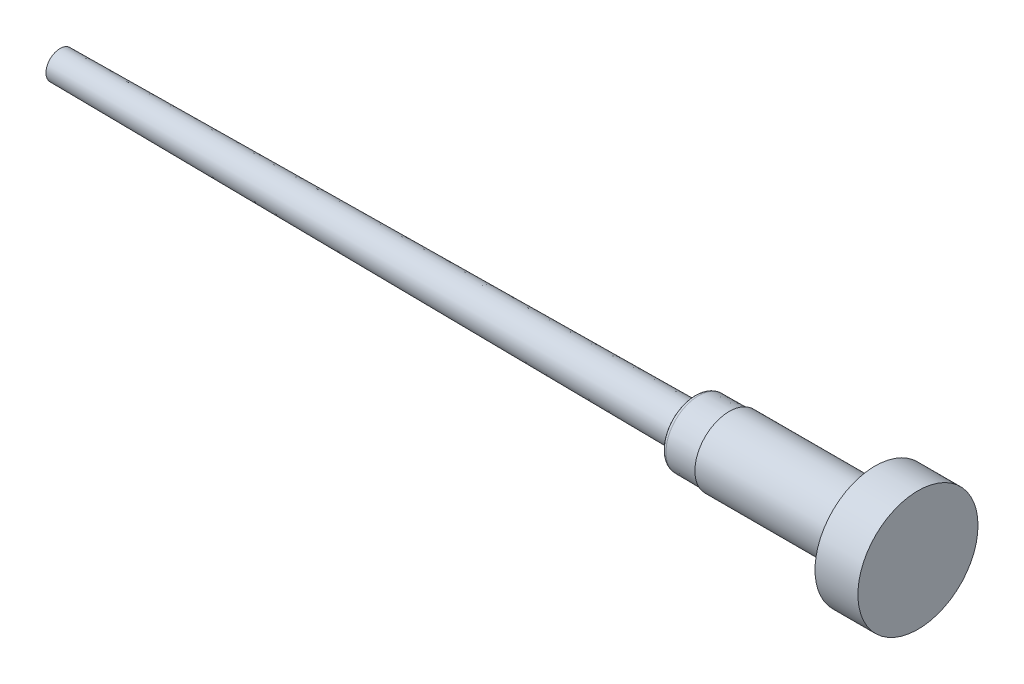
ISO-10303-21;
HEADER;
FILE_DESCRIPTION(('STEP AP214'),'2;1');
FILE_NAME('part.step','',(''),(''),'','','');
FILE_SCHEMA(('AUTOMOTIVE_DESIGN { 1 0 10303 214 1 1 1 1 }'));
ENDSEC;
DATA;
#1=APPLICATION_CONTEXT('core data for automotive mechanical design processes');
#2=APPLICATION_PROTOCOL_DEFINITION('international standard','automotive_design',2000,#1);
#3=PRODUCT_CONTEXT('',#1,'mechanical');
#4=PRODUCT('Part','Part','',(#3));
#5=PRODUCT_RELATED_PRODUCT_CATEGORY('part','',(#4));
#6=PRODUCT_DEFINITION_FORMATION('','',#4);
#7=PRODUCT_DEFINITION_CONTEXT('part definition',#1,'design');
#8=PRODUCT_DEFINITION('design','',#6,#7);
#9=PRODUCT_DEFINITION_SHAPE('','',#8);
#10=(LENGTH_UNIT() NAMED_UNIT(*) SI_UNIT(.MILLI.,.METRE.));
#11=(NAMED_UNIT(*) PLANE_ANGLE_UNIT() SI_UNIT($,.RADIAN.));
#12=(NAMED_UNIT(*) SI_UNIT($,.STERADIAN.) SOLID_ANGLE_UNIT());
#13=UNCERTAINTY_MEASURE_WITH_UNIT(LENGTH_MEASURE(1.E-05),#10,'distance_accuracy_value','');
#14=(GEOMETRIC_REPRESENTATION_CONTEXT(3) GLOBAL_UNCERTAINTY_ASSIGNED_CONTEXT((#13)) GLOBAL_UNIT_ASSIGNED_CONTEXT((#10,
#11,#12)) REPRESENTATION_CONTEXT('',''));
#15=CARTESIAN_POINT('',(0.,0.,0.));
#16=DIRECTION('',(0.,0.,1.));
#17=DIRECTION('',(1.,0.,0.));
#18=AXIS2_PLACEMENT_3D('',#15,#16,#17);
#19=CARTESIAN_POINT('',(87.,2.4459601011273E-13,0.));
#20=DIRECTION('',(1.,0.,0.));
#21=DIRECTION('',(0.,0.,-1.));
#22=AXIS2_PLACEMENT_3D('',#19,#20,#21);
#23=CYLINDRICAL_SURFACE('',#22,6.99999999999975);
#24=CARTESIAN_POINT('',(82.0000000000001,2.4459601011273E-13,0.));
#25=DIRECTION('',(1.,0.,0.));
#26=DIRECTION('',(0.,0.,-1.));
#27=AXIS2_PLACEMENT_3D('',#24,#25,#26);
#28=CIRCLE('',#27,6.99999999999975);
#29=CARTESIAN_POINT('',(82.0000000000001,2.4459601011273E-13,-6.99999999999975));
#30=VERTEX_POINT('',#29);
#31=EDGE_CURVE('E10',#30,#30,#28,.T.);
#32=ORIENTED_EDGE('',*,*,#31,.T.);
#33=EDGE_LOOP('',(#32));
#34=FACE_BOUND('',#33,.T.);
#35=CARTESIAN_POINT('',(87.,2.4459601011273E-13,0.));
#36=DIRECTION('',(1.,0.,0.));
#37=DIRECTION('',(0.,0.,-1.));
#38=AXIS2_PLACEMENT_3D('',#35,#36,#37);
#39=CIRCLE('',#38,6.99999999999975);
#40=CARTESIAN_POINT('',(87.,2.4459601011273E-13,-6.99999999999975));
#41=VERTEX_POINT('',#40);
#42=EDGE_CURVE('E66',#41,#41,#39,.T.);
#43=ORIENTED_EDGE('',*,*,#42,.F.);
#44=EDGE_LOOP('',(#43));
#45=FACE_BOUND('',#44,.T.);
#46=ADVANCED_FACE('F29',(#34,#45),#23,.T.);
#47=CARTESIAN_POINT('',(82.,7.,0.));
#48=DIRECTION('',(-1.,0.,0.));
#49=DIRECTION('',(0.,0.,1.));
#50=AXIS2_PLACEMENT_3D('',#47,#48,#49);
#51=PLANE('',#50);
#52=CARTESIAN_POINT('',(82.,2.4459601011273E-13,0.));
#53=DIRECTION('',(1.,0.,0.));
#54=DIRECTION('',(0.,0.,-1.));
#55=AXIS2_PLACEMENT_3D('',#52,#53,#54);
#56=CIRCLE('',#55,4.50000000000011);
#57=CARTESIAN_POINT('',(82.,2.4459601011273E-13,-4.50000000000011));
#58=VERTEX_POINT('',#57);
#59=EDGE_CURVE('E35',#58,#58,#56,.T.);
#60=ORIENTED_EDGE('',*,*,#59,.T.);
#61=EDGE_LOOP('',(#60));
#62=FACE_BOUND('',#61,.T.);
#63=ORIENTED_EDGE('',*,*,#31,.F.);
#64=EDGE_LOOP('',(#63));
#65=FACE_BOUND('',#64,.T.);
#66=ADVANCED_FACE('F73',(#62,#65),#51,.T.);
#67=CARTESIAN_POINT('',(81.5,2.4459601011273E-13,0.));
#68=DIRECTION('',(1.,0.,0.));
#69=DIRECTION('',(0.,0.,-1.));
#70=AXIS2_PLACEMENT_3D('',#67,#68,#69);
#71=TOROIDAL_SURFACE('',#70,4.50000000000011,0.5);
#72=CARTESIAN_POINT('',(81.5,2.4459601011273E-13,0.));
#73=DIRECTION('',(1.,0.,0.));
#74=DIRECTION('',(0.,0.,-1.));
#75=AXIS2_PLACEMENT_3D('',#72,#73,#74);
#76=CIRCLE('',#75,4.00000000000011);
#77=CARTESIAN_POINT('',(81.5,2.4459601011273E-13,-4.00000000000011));
#78=VERTEX_POINT('',#77);
#79=EDGE_CURVE('E39',#78,#78,#76,.T.);
#80=ORIENTED_EDGE('',*,*,#79,.T.);
#81=EDGE_LOOP('',(#80));
#82=FACE_BOUND('',#81,.T.);
#83=ORIENTED_EDGE('',*,*,#59,.F.);
#84=EDGE_LOOP('',(#83));
#85=FACE_BOUND('',#84,.T.);
#86=ADVANCED_FACE('F77',(#82,#85),#71,.F.);
#87=CARTESIAN_POINT('',(87.,2.4459601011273E-13,0.));
#88=DIRECTION('',(1.,0.,0.));
#89=DIRECTION('',(0.,0.,-1.));
#90=AXIS2_PLACEMENT_3D('',#87,#88,#89);
#91=CYLINDRICAL_SURFACE('',#90,4.00000000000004);
#92=CARTESIAN_POINT('',(65.,2.4459601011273E-13,0.));
#93=DIRECTION('',(1.,0.,0.));
#94=DIRECTION('',(0.,0.,-1.));
#95=AXIS2_PLACEMENT_3D('',#92,#93,#94);
#96=CIRCLE('',#95,3.99999999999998);
#97=CARTESIAN_POINT('',(65.,2.4459601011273E-13,-3.99999999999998));
#98=VERTEX_POINT('',#97);
#99=EDGE_CURVE('E43',#98,#98,#96,.T.);
#100=ORIENTED_EDGE('',*,*,#99,.T.);
#101=EDGE_LOOP('',(#100));
#102=FACE_BOUND('',#101,.T.);
#103=ORIENTED_EDGE('',*,*,#79,.F.);
#104=EDGE_LOOP('',(#103));
#105=FACE_BOUND('',#104,.T.);
#106=ADVANCED_FACE('F81',(#102,#105),#91,.T.);
#107=CARTESIAN_POINT('',(64.9999999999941,4.00000000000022,0.));
#108=DIRECTION('',(-1.,0.,0.));
#109=DIRECTION('',(0.,0.,1.));
#110=AXIS2_PLACEMENT_3D('',#107,#108,#109);
#111=PLANE('',#110);
#112=CARTESIAN_POINT('',(64.9999999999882,2.4459601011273E-13,0.));
#113=DIRECTION('',(1.,0.,0.));
#114=DIRECTION('',(0.,0.,-1.));
#115=AXIS2_PLACEMENT_3D('',#112,#113,#114);
#116=CIRCLE('',#115,3.84168108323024);
#117=CARTESIAN_POINT('',(64.9999999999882,2.4459601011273E-13,-3.84168108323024));
#118=VERTEX_POINT('',#117);
#119=EDGE_CURVE('E48',#118,#118,#116,.T.);
#120=ORIENTED_EDGE('',*,*,#119,.T.);
#121=EDGE_LOOP('',(#120));
#122=FACE_BOUND('',#121,.T.);
#123=ORIENTED_EDGE('',*,*,#99,.F.);
#124=EDGE_LOOP('',(#123));
#125=FACE_BOUND('',#124,.T.);
#126=ADVANCED_FACE('F88',(#122,#125),#111,.T.);
#127=CARTESIAN_POINT('',(64.9999999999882,2.4459601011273E-13,0.));
#128=DIRECTION('',(1.,0.,0.));
#129=DIRECTION('',(0.,0.,-1.));
#130=AXIS2_PLACEMENT_3D('',#127,#128,#129);
#131=CONICAL_SURFACE('',#130,3.84168108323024,0.00872664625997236);
#132=CARTESIAN_POINT('',(61.435636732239,2.4459601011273E-13,0.));
#133=DIRECTION('',(1.,0.,0.));
#134=DIRECTION('',(0.,0.,-1.));
#135=AXIS2_PLACEMENT_3D('',#132,#133,#134);
#136=CIRCLE('',#135,3.81057535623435);
#137=CARTESIAN_POINT('',(61.435636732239,2.4459601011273E-13,-3.81057535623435));
#138=VERTEX_POINT('',#137);
#139=EDGE_CURVE('E51',#138,#138,#136,.T.);
#140=ORIENTED_EDGE('',*,*,#139,.T.);
#141=EDGE_LOOP('',(#140));
#142=FACE_BOUND('',#141,.T.);
#143=ORIENTED_EDGE('',*,*,#119,.F.);
#144=EDGE_LOOP('',(#143));
#145=FACE_BOUND('',#144,.T.);
#146=ADVANCED_FACE('F92',(#142,#145),#131,.T.);
#147=CARTESIAN_POINT('',(61.4399999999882,2.4459601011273E-13,0.));
#148=DIRECTION('',(1.,0.,0.));
#149=DIRECTION('',(0.,0.,-1.));
#150=AXIS2_PLACEMENT_3D('',#147,#148,#149);
#151=TOROIDAL_SURFACE('',#150,3.31059439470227,0.5);
#152=CARTESIAN_POINT('',(60.9399999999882,2.4459601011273E-13,0.));
#153=DIRECTION('',(1.,0.,0.));
#154=DIRECTION('',(0.,0.,-1.));
#155=AXIS2_PLACEMENT_3D('',#152,#153,#154);
#156=CIRCLE('',#155,3.31059439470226);
#157=CARTESIAN_POINT('',(60.9399999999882,2.4459601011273E-13,-3.31059439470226));
#158=VERTEX_POINT('',#157);
#159=EDGE_CURVE('E54',#158,#158,#156,.T.);
#160=ORIENTED_EDGE('',*,*,#159,.T.);
#161=EDGE_LOOP('',(#160));
#162=FACE_BOUND('',#161,.T.);
#163=ORIENTED_EDGE('',*,*,#139,.F.);
#164=EDGE_LOOP('',(#163));
#165=FACE_BOUND('',#164,.T.);
#166=ADVANCED_FACE('F96',(#162,#165),#151,.T.);
#167=CARTESIAN_POINT('',(60.9399999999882,3.3105943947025,0.));
#168=DIRECTION('',(-1.,0.,0.));
#169=DIRECTION('',(0.,0.,1.));
#170=AXIS2_PLACEMENT_3D('',#167,#168,#169);
#171=PLANE('',#170);
#172=CARTESIAN_POINT('',(60.9399999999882,2.4459601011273E-13,0.));
#173=DIRECTION('',(1.,0.,0.));
#174=DIRECTION('',(0.,0.,-1.));
#175=AXIS2_PLACEMENT_3D('',#172,#173,#174);
#176=CIRCLE('',#175,2.77923356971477);
#177=CARTESIAN_POINT('',(60.9399999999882,2.4459601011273E-13,-2.77923356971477));
#178=VERTEX_POINT('',#177);
#179=EDGE_CURVE('E57',#178,#178,#176,.T.);
#180=ORIENTED_EDGE('',*,*,#179,.T.);
#181=EDGE_LOOP('',(#180));
#182=FACE_BOUND('',#181,.T.);
#183=ORIENTED_EDGE('',*,*,#159,.F.);
#184=EDGE_LOOP('',(#183));
#185=FACE_BOUND('',#184,.T.);
#186=ADVANCED_FACE('F100',(#182,#185),#171,.T.);
#187=CARTESIAN_POINT('',(60.4399999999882,2.4459601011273E-13,0.));
#188=DIRECTION('',(1.,0.,0.));
#189=DIRECTION('',(0.,0.,-1.));
#190=AXIS2_PLACEMENT_3D('',#187,#188,#189);
#191=TOROIDAL_SURFACE('',#190,2.77923356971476,0.5);
#192=CARTESIAN_POINT('',(60.4443632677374,2.4459601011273E-13,0.));
#193=DIRECTION('',(1.,0.,0.));
#194=DIRECTION('',(0.,0.,-1.));
#195=AXIS2_PLACEMENT_3D('',#192,#193,#194);
#196=CIRCLE('',#195,2.27925260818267);
#197=CARTESIAN_POINT('',(60.4443632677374,2.4459601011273E-13,-2.27925260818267));
#198=VERTEX_POINT('',#197);
#199=EDGE_CURVE('E60',#198,#198,#196,.T.);
#200=ORIENTED_EDGE('',*,*,#199,.T.);
#201=EDGE_LOOP('',(#200));
#202=FACE_BOUND('',#201,.T.);
#203=ORIENTED_EDGE('',*,*,#179,.F.);
#204=EDGE_LOOP('',(#203));
#205=FACE_BOUND('',#204,.T.);
#206=ADVANCED_FACE('F104',(#202,#205),#191,.F.);
#207=CARTESIAN_POINT('',(60.4443632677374,2.4459601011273E-13,0.));
#208=DIRECTION('',(1.,0.,0.));
#209=DIRECTION('',(0.,0.,-1.));
#210=AXIS2_PLACEMENT_3D('',#207,#208,#209);
#211=CONICAL_SURFACE('',#210,2.27925260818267,0.0087266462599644);
#212=CARTESIAN_POINT('',(-13.,2.4459601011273E-13,0.));
#213=DIRECTION('',(1.,0.,0.));
#214=DIRECTION('',(0.,0.,-1.));
#215=AXIS2_PLACEMENT_3D('',#212,#213,#214);
#216=CIRCLE('',#215,1.6383133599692);
#217=CARTESIAN_POINT('',(-13.,2.4459601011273E-13,-1.6383133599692));
#218=VERTEX_POINT('',#217);
#219=EDGE_CURVE('E63',#218,#218,#216,.T.);
#220=ORIENTED_EDGE('',*,*,#219,.T.);
#221=EDGE_LOOP('',(#220));
#222=FACE_BOUND('',#221,.T.);
#223=ORIENTED_EDGE('',*,*,#199,.F.);
#224=EDGE_LOOP('',(#223));
#225=FACE_BOUND('',#224,.T.);
#226=ADVANCED_FACE('F108',(#222,#225),#211,.T.);
#227=CARTESIAN_POINT('',(-13.,1.63831335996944,0.));
#228=DIRECTION('',(-1.,0.,0.));
#229=DIRECTION('',(0.,0.,1.));
#230=AXIS2_PLACEMENT_3D('',#227,#228,#229);
#231=PLANE('',#230);
#232=ORIENTED_EDGE('',*,*,#219,.F.);
#233=EDGE_LOOP('',(#232));
#234=FACE_BOUND('',#233,.T.);
#235=ADVANCED_FACE('F112',(#234),#231,.T.);
#236=CARTESIAN_POINT('',(87.,2.4459601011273E-13,0.));
#237=DIRECTION('',(1.,0.,0.));
#238=DIRECTION('',(0.,0.,-1.));
#239=AXIS2_PLACEMENT_3D('',#236,#237,#238);
#240=PLANE('',#239);
#241=ORIENTED_EDGE('',*,*,#42,.T.);
#242=EDGE_LOOP('',(#241));
#243=FACE_BOUND('',#242,.T.);
#244=ADVANCED_FACE('F70',(#243),#240,.T.);
#245=CLOSED_SHELL('',(#46,#66,#86,#106,#126,#146,#166,#186,#206,#226,#235,#244));
#246=MANIFOLD_SOLID_BREP('B2',#245);
#247=ADVANCED_BREP_SHAPE_REPRESENTATION('',(#18,#246),#14);
#248=SHAPE_DEFINITION_REPRESENTATION(#9,#247);
ENDSEC;
END-ISO-10303-21;
